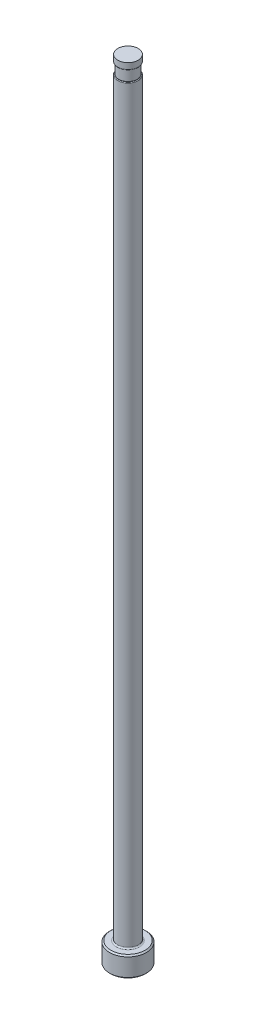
from build123d import *

# Parameters (mm, degrees)
CHAMFER1_SIZE     = 0.254
FILLET1_R         = 0.254
SKETCH2_W         = 0.2032
SKETCH2_H         = 2.032
D_SLOT_DEPTH      = 153.483544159
D_SLOT_DEPTH_BACK = 153.483544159
SKETCH5_W         = 0.0127
SKETCH5_H         = 1.27
FILLET2_R         = 0.127


with BuildPart() as part:
    # Sketch1 → Revolve1 (revolve)
    with BuildSketch(Plane.XY, mode=Mode.PRIVATE) as revolve1_sk:
        Polygon((0, 0), (-3.5687, 0), (-3.5687, 3.9624), (-1.98374, 3.9624), (-1.98374, 152.4), (0, 152.4), align=None)
    revolve(revolve1_sk.sketch.rotate(Axis((0, 259.958771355, 0), (0, -1, 0)), 270), axis=Axis((0, 259.958771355, 0), (0, -1, 0)))

    # Chamfer1
    chamfer1_edges = [part.edges().sort_by_distance(p)[0] for p in [
        (0, 3.9624, -3.5687),
        (0, 0, -3.5687),
    ]]
    chamfer(chamfer1_edges, length=CHAMFER1_SIZE)

    # Fillet1
    fillet1_edges = [part.edges().sort_by_distance(p)[0] for p in [
        (0, 3.9624, -1.98374),
    ]]
    fillet(fillet1_edges, radius=FILLET1_R)

    # Sketch2 → Vent Relief (revolve, cut)
    with BuildSketch(Plane.XY, mode=Mode.PRIVATE) as vent_relief_sk:
        with Locations((-1.88214, 150.114)):
            Rectangle(SKETCH2_W, SKETCH2_H)
    revolve(vent_relief_sk.sketch.rotate(Axis((0, 153.448281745, 0), (0, -1, 0)), 270), axis=Axis((0, 153.448281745, 0), (0, -1, 0)), mode=Mode.SUBTRACT)

    # Sketch3 → D-Slot (cut, two sides: drawn at the far end of the back side and taken through both)
    with BuildSketch(Plane.XY.offset(-D_SLOT_DEPTH_BACK)):
        with BuildLine():
            Line((-1.78054, 150.114), (-1.78054, 86.614))
            ThreePointArc((-1.78054, 86.614), (-1.831753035, 86.046038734), (-1.98374, 85.4964))
            Line((-1.98374, 85.4964), (-1.98374, 150.114))
            Line((-1.98374, 150.114), (-1.78054, 150.114))
        make_face()
    extrude(amount=D_SLOT_DEPTH + D_SLOT_DEPTH_BACK, mode=Mode.SUBTRACT)

    # Sketch5 → Vent Diameter (revolve, cut)
    with BuildSketch(Plane.XY, mode=Mode.PRIVATE) as vent_diameter_sk:
        with Locations((-1.97739, 151.765)):
            Rectangle(SKETCH5_W, SKETCH5_H)
    revolve(vent_diameter_sk.sketch.rotate(Axis((0, 152.687735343, 0), (0, -1, 0)), 90), axis=Axis((0, 152.687735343, 0), (0, -1, 0)), mode=Mode.SUBTRACT)

    # Fillet2
    fillet2_edges = [part.edges().sort_by_distance(p)[0] for p in [
        (1.683772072, 149.098, -1.04887368),
        (0, 151.13, 1.97104),
    ]]
    fillet(fillet2_edges, radius=FILLET2_R)


solid = part.part
